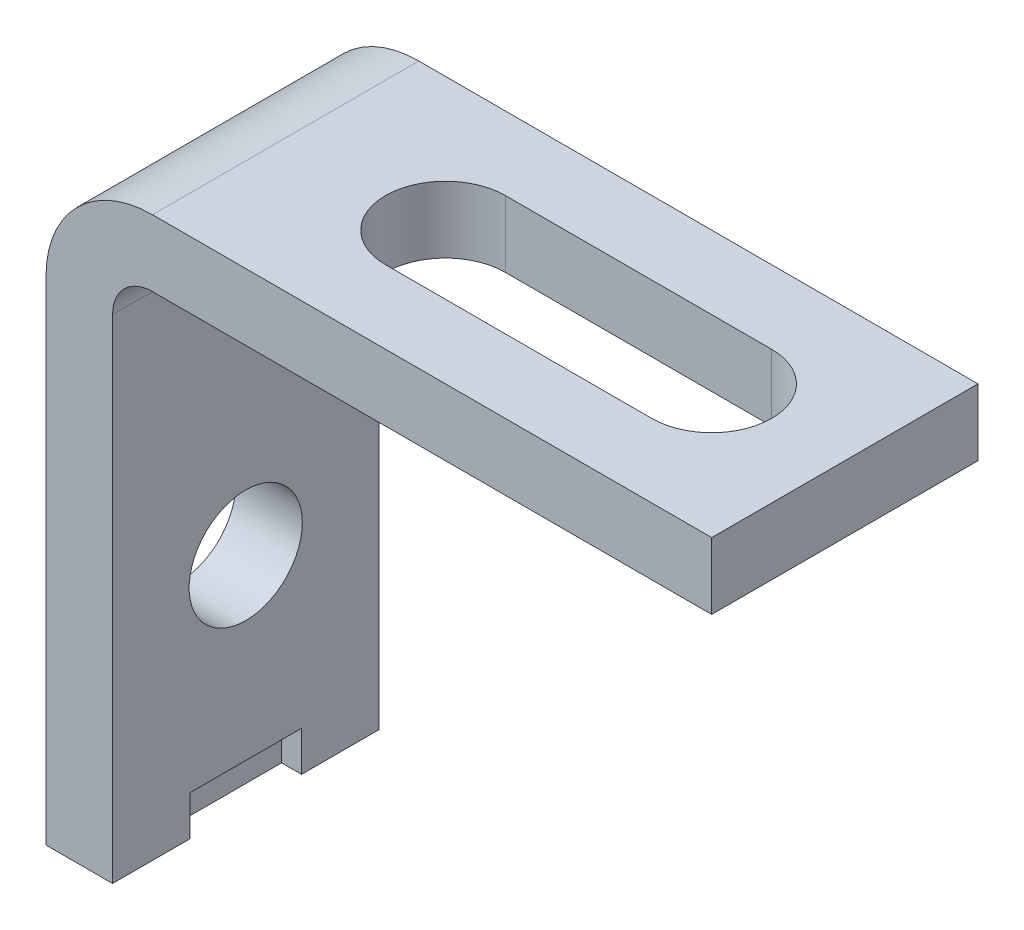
ISO-10303-21;
HEADER;
FILE_DESCRIPTION(('STEP AP214'),'2;1');
FILE_NAME('part.step','',(''),(''),'','','');
FILE_SCHEMA(('AUTOMOTIVE_DESIGN { 1 0 10303 214 1 1 1 1 }'));
ENDSEC;
DATA;
#1=APPLICATION_CONTEXT('core data for automotive mechanical design processes');
#2=APPLICATION_PROTOCOL_DEFINITION('international standard','automotive_design',2000,#1);
#3=PRODUCT_CONTEXT('',#1,'mechanical');
#4=PRODUCT('Part','Part','',(#3));
#5=PRODUCT_RELATED_PRODUCT_CATEGORY('part','',(#4));
#6=PRODUCT_DEFINITION_FORMATION('','',#4);
#7=PRODUCT_DEFINITION_CONTEXT('part definition',#1,'design');
#8=PRODUCT_DEFINITION('design','',#6,#7);
#9=PRODUCT_DEFINITION_SHAPE('','',#8);
#10=(LENGTH_UNIT() NAMED_UNIT(*) SI_UNIT(.MILLI.,.METRE.));
#11=(NAMED_UNIT(*) PLANE_ANGLE_UNIT() SI_UNIT($,.RADIAN.));
#12=(NAMED_UNIT(*) SI_UNIT($,.STERADIAN.) SOLID_ANGLE_UNIT());
#13=UNCERTAINTY_MEASURE_WITH_UNIT(LENGTH_MEASURE(1.E-05),#10,'distance_accuracy_value','');
#14=(GEOMETRIC_REPRESENTATION_CONTEXT(3) GLOBAL_UNCERTAINTY_ASSIGNED_CONTEXT((#13)) GLOBAL_UNIT_ASSIGNED_CONTEXT((#10,
#11,#12)) REPRESENTATION_CONTEXT('',''));
#15=CARTESIAN_POINT('',(0.,0.,0.));
#16=DIRECTION('',(0.,0.,1.));
#17=DIRECTION('',(1.,0.,0.));
#18=AXIS2_PLACEMENT_3D('',#15,#16,#17);
#19=CARTESIAN_POINT('',(20.,45.,-5.5));
#20=DIRECTION('',(0.,0.,1.));
#21=DIRECTION('',(1.,0.,0.));
#22=AXIS2_PLACEMENT_3D('',#19,#20,#21);
#23=PLANE('',#22);
#24=DIRECTION('',(0.,-1.,0.));
#25=VECTOR('',#24,1.);
#26=CARTESIAN_POINT('',(20.,45.,-5.5));
#27=LINE('',#26,#25);
#28=CARTESIAN_POINT('',(20.,40.,-5.5));
#29=VERTEX_POINT('',#28);
#30=CARTESIAN_POINT('',(20.,45.,-5.5));
#31=VERTEX_POINT('',#30);
#32=EDGE_CURVE('E199',#29,#31,#27,.F.);
#33=ORIENTED_EDGE('',*,*,#32,.T.);
#34=DIRECTION('',(1.,0.,0.));
#35=VECTOR('',#34,1.);
#36=CARTESIAN_POINT('',(50.,45.,-5.5));
#37=LINE('',#36,#35);
#38=CARTESIAN_POINT('',(40.,45.,-5.5));
#39=VERTEX_POINT('',#38);
#40=EDGE_CURVE('E238',#39,#31,#37,.F.);
#41=ORIENTED_EDGE('',*,*,#40,.F.);
#42=DIRECTION('',(0.,-1.,0.));
#43=VECTOR('',#42,1.);
#44=CARTESIAN_POINT('',(40.,45.,-5.5));
#45=LINE('',#44,#43);
#46=CARTESIAN_POINT('',(40.,40.,-5.5));
#47=VERTEX_POINT('',#46);
#48=EDGE_CURVE('E135',#39,#47,#45,.T.);
#49=ORIENTED_EDGE('',*,*,#48,.T.);
#50=DIRECTION('',(1.,0.,0.));
#51=VECTOR('',#50,1.);
#52=CARTESIAN_POINT('',(8.,40.,-5.5));
#53=LINE('',#52,#51);
#54=EDGE_CURVE('E162',#29,#47,#53,.T.);
#55=ORIENTED_EDGE('',*,*,#54,.F.);
#56=EDGE_LOOP('',(#33,#41,#49,#55));
#57=FACE_BOUND('',#56,.T.);
#58=ADVANCED_FACE('F15',(#57),#23,.F.);
#59=CARTESIAN_POINT('',(20.,45.,-10.));
#60=DIRECTION('',(0.,-1.,0.));
#61=DIRECTION('',(0.,0.,-1.));
#62=AXIS2_PLACEMENT_3D('',#59,#60,#61);
#63=CYLINDRICAL_SURFACE('',#62,4.5);
#64=DIRECTION('',(0.,1.,0.));
#65=VECTOR('',#64,1.);
#66=CARTESIAN_POINT('',(20.,45.,-14.5));
#67=LINE('',#66,#65);
#68=CARTESIAN_POINT('',(20.,40.,-14.5));
#69=VERTEX_POINT('',#68);
#70=CARTESIAN_POINT('',(20.,45.,-14.5));
#71=VERTEX_POINT('',#70);
#72=EDGE_CURVE('E150',#69,#71,#67,.T.);
#73=ORIENTED_EDGE('',*,*,#72,.T.);
#74=CARTESIAN_POINT('',(20.,45.,-10.));
#75=DIRECTION('',(0.,-1.,0.));
#76=DIRECTION('',(0.,0.,-1.));
#77=AXIS2_PLACEMENT_3D('',#74,#75,#76);
#78=CIRCLE('',#77,4.5);
#79=EDGE_CURVE('E236',#31,#71,#78,.T.);
#80=ORIENTED_EDGE('',*,*,#79,.F.);
#81=ORIENTED_EDGE('',*,*,#32,.F.);
#82=CARTESIAN_POINT('',(20.,40.,-10.));
#83=DIRECTION('',(0.,-1.,0.));
#84=DIRECTION('',(0.,0.,-1.));
#85=AXIS2_PLACEMENT_3D('',#82,#83,#84);
#86=CIRCLE('',#85,4.5);
#87=EDGE_CURVE('E158',#69,#29,#86,.F.);
#88=ORIENTED_EDGE('',*,*,#87,.F.);
#89=EDGE_LOOP('',(#73,#80,#81,#88));
#90=FACE_BOUND('',#89,.T.);
#91=ADVANCED_FACE('F506',(#90),#63,.F.);
#92=CARTESIAN_POINT('',(40.,45.,-14.5));
#93=DIRECTION('',(0.,0.,-1.));
#94=DIRECTION('',(-1.,0.,0.));
#95=AXIS2_PLACEMENT_3D('',#92,#93,#94);
#96=PLANE('',#95);
#97=DIRECTION('',(0.,-1.,0.));
#98=VECTOR('',#97,1.);
#99=CARTESIAN_POINT('',(40.,45.,-14.5));
#100=LINE('',#99,#98);
#101=CARTESIAN_POINT('',(40.,40.,-14.5));
#102=VERTEX_POINT('',#101);
#103=CARTESIAN_POINT('',(40.,45.,-14.5));
#104=VERTEX_POINT('',#103);
#105=EDGE_CURVE('E140',#102,#104,#100,.F.);
#106=ORIENTED_EDGE('',*,*,#105,.T.);
#107=DIRECTION('',(1.,0.,0.));
#108=VECTOR('',#107,1.);
#109=CARTESIAN_POINT('',(50.,45.,-14.5));
#110=LINE('',#109,#108);
#111=EDGE_CURVE('E235',#71,#104,#110,.T.);
#112=ORIENTED_EDGE('',*,*,#111,.F.);
#113=ORIENTED_EDGE('',*,*,#72,.F.);
#114=DIRECTION('',(1.,0.,0.));
#115=VECTOR('',#114,1.);
#116=CARTESIAN_POINT('',(8.,40.,-14.5));
#117=LINE('',#116,#115);
#118=EDGE_CURVE('E153',#102,#69,#117,.F.);
#119=ORIENTED_EDGE('',*,*,#118,.F.);
#120=EDGE_LOOP('',(#106,#112,#113,#119));
#121=FACE_BOUND('',#120,.T.);
#122=ADVANCED_FACE('F154',(#121),#96,.F.);
#123=CARTESIAN_POINT('',(40.,45.,-10.));
#124=DIRECTION('',(0.,-1.,0.));
#125=DIRECTION('',(0.,0.,-1.));
#126=AXIS2_PLACEMENT_3D('',#123,#124,#125);
#127=CYLINDRICAL_SURFACE('',#126,4.5);
#128=ORIENTED_EDGE('',*,*,#48,.F.);
#129=CARTESIAN_POINT('',(40.,45.,-10.));
#130=DIRECTION('',(0.,-1.,0.));
#131=DIRECTION('',(0.,0.,-1.));
#132=AXIS2_PLACEMENT_3D('',#129,#130,#131);
#133=CIRCLE('',#132,4.5);
#134=EDGE_CURVE('E146',#104,#39,#133,.T.);
#135=ORIENTED_EDGE('',*,*,#134,.F.);
#136=ORIENTED_EDGE('',*,*,#105,.F.);
#137=CARTESIAN_POINT('',(40.,40.,-10.));
#138=DIRECTION('',(0.,-1.,0.));
#139=DIRECTION('',(0.,0.,-1.));
#140=AXIS2_PLACEMENT_3D('',#137,#138,#139);
#141=CIRCLE('',#140,4.5);
#142=EDGE_CURVE('E19',#47,#102,#141,.F.);
#143=ORIENTED_EDGE('',*,*,#142,.F.);
#144=EDGE_LOOP('',(#128,#135,#136,#143));
#145=FACE_BOUND('',#144,.T.);
#146=ADVANCED_FACE('F142',(#145),#127,.F.);
#147=CARTESIAN_POINT('',(5.,0.,-14.191));
#148=DIRECTION('',(0.,0.,-1.));
#149=DIRECTION('',(-1.,0.,0.));
#150=AXIS2_PLACEMENT_3D('',#147,#148,#149);
#151=PLANE('',#150);
#152=DIRECTION('',(-1.,0.,0.));
#153=VECTOR('',#152,1.);
#154=CARTESIAN_POINT('',(5.,0.,-14.191));
#155=LINE('',#154,#153);
#156=CARTESIAN_POINT('',(5.,0.,-14.191));
#157=VERTEX_POINT('',#156);
#158=CARTESIAN_POINT('',(3.5,0.,-14.191));
#159=VERTEX_POINT('',#158);
#160=EDGE_CURVE('E189',#157,#159,#155,.T.);
#161=ORIENTED_EDGE('',*,*,#160,.F.);
#162=DIRECTION('',(0.,1.,0.));
#163=VECTOR('',#162,1.);
#164=CARTESIAN_POINT('',(5.,0.,-14.191));
#165=LINE('',#164,#163);
#166=CARTESIAN_POINT('',(5.,3.,-14.191));
#167=VERTEX_POINT('',#166);
#168=EDGE_CURVE('E173',#167,#157,#165,.F.);
#169=ORIENTED_EDGE('',*,*,#168,.F.);
#170=DIRECTION('',(1.,0.,0.));
#171=VECTOR('',#170,1.);
#172=CARTESIAN_POINT('',(5.,3.,-14.191));
#173=LINE('',#172,#171);
#174=CARTESIAN_POINT('',(3.5,3.,-14.191));
#175=VERTEX_POINT('',#174);
#176=EDGE_CURVE('E166',#167,#175,#173,.F.);
#177=ORIENTED_EDGE('',*,*,#176,.T.);
#178=DIRECTION('',(0.,1.,0.));
#179=VECTOR('',#178,1.);
#180=CARTESIAN_POINT('',(3.5,1.5,-14.191));
#181=LINE('',#180,#179);
#182=EDGE_CURVE('E207',#159,#175,#181,.T.);
#183=ORIENTED_EDGE('',*,*,#182,.F.);
#184=EDGE_LOOP('',(#161,#169,#177,#183));
#185=FACE_BOUND('',#184,.T.);
#186=ADVANCED_FACE('F336',(#185),#151,.F.);
#187=CARTESIAN_POINT('',(5.,3.,-5.809));
#188=DIRECTION('',(0.,0.,1.));
#189=DIRECTION('',(1.,0.,0.));
#190=AXIS2_PLACEMENT_3D('',#187,#188,#189);
#191=PLANE('',#190);
#192=DIRECTION('',(1.,0.,0.));
#193=VECTOR('',#192,1.);
#194=CARTESIAN_POINT('',(5.,3.,-5.809));
#195=LINE('',#194,#193);
#196=CARTESIAN_POINT('',(3.5,3.,-5.809));
#197=VERTEX_POINT('',#196);
#198=CARTESIAN_POINT('',(5.,3.,-5.809));
#199=VERTEX_POINT('',#198);
#200=EDGE_CURVE('E186',#197,#199,#195,.T.);
#201=ORIENTED_EDGE('',*,*,#200,.T.);
#202=DIRECTION('',(0.,1.,0.));
#203=VECTOR('',#202,1.);
#204=CARTESIAN_POINT('',(5.,0.,-5.809));
#205=LINE('',#204,#203);
#206=CARTESIAN_POINT('',(5.,0.,-5.809));
#207=VERTEX_POINT('',#206);
#208=EDGE_CURVE('E172',#207,#199,#205,.T.);
#209=ORIENTED_EDGE('',*,*,#208,.F.);
#210=DIRECTION('',(1.,0.,0.));
#211=VECTOR('',#210,1.);
#212=CARTESIAN_POINT('',(5.,0.,-5.809));
#213=LINE('',#212,#211);
#214=CARTESIAN_POINT('',(3.5,0.,-5.809));
#215=VERTEX_POINT('',#214);
#216=EDGE_CURVE('E187',#215,#207,#213,.T.);
#217=ORIENTED_EDGE('',*,*,#216,.F.);
#218=DIRECTION('',(0.,1.,0.));
#219=VECTOR('',#218,1.);
#220=CARTESIAN_POINT('',(3.5,1.5,-5.809));
#221=LINE('',#220,#219);
#222=EDGE_CURVE('E201',#197,#215,#221,.F.);
#223=ORIENTED_EDGE('',*,*,#222,.F.);
#224=EDGE_LOOP('',(#201,#209,#217,#223));
#225=FACE_BOUND('',#224,.T.);
#226=ADVANCED_FACE('F343',(#225),#191,.F.);
#227=CARTESIAN_POINT('',(5.,3.,-14.191));
#228=DIRECTION('',(0.,1.,0.));
#229=DIRECTION('',(0.,0.,1.));
#230=AXIS2_PLACEMENT_3D('',#227,#228,#229);
#231=PLANE('',#230);
#232=ORIENTED_EDGE('',*,*,#176,.F.);
#233=DIRECTION('',(0.,0.,-1.));
#234=VECTOR('',#233,1.);
#235=CARTESIAN_POINT('',(5.,3.,0.));
#236=LINE('',#235,#234);
#237=EDGE_CURVE('E190',#199,#167,#236,.T.);
#238=ORIENTED_EDGE('',*,*,#237,.F.);
#239=ORIENTED_EDGE('',*,*,#200,.F.);
#240=DIRECTION('',(0.,0.,-1.));
#241=VECTOR('',#240,1.);
#242=CARTESIAN_POINT('',(3.5,3.,-10.));
#243=LINE('',#242,#241);
#244=EDGE_CURVE('E204',#175,#197,#243,.F.);
#245=ORIENTED_EDGE('',*,*,#244,.F.);
#246=EDGE_LOOP('',(#232,#238,#239,#245));
#247=FACE_BOUND('',#246,.T.);
#248=ADVANCED_FACE('F474',(#247),#231,.F.);
#249=CARTESIAN_POINT('',(8.,37.,0.));
#250=DIRECTION('',(0.,0.,-1.));
#251=DIRECTION('',(-1.,0.,0.));
#252=AXIS2_PLACEMENT_3D('',#249,#250,#251);
#253=CYLINDRICAL_SURFACE('',#252,3.);
#254=DIRECTION('',(0.,0.,-1.));
#255=VECTOR('',#254,1.);
#256=CARTESIAN_POINT('',(8.,40.,0.));
#257=LINE('',#256,#255);
#258=CARTESIAN_POINT('',(8.,40.,0.));
#259=VERTEX_POINT('',#258);
#260=CARTESIAN_POINT('',(8.,40.,-20.));
#261=VERTEX_POINT('',#260);
#262=EDGE_CURVE('E163',#259,#261,#257,.T.);
#263=ORIENTED_EDGE('',*,*,#262,.F.);
#264=CARTESIAN_POINT('',(8.,37.,0.));
#265=DIRECTION('',(0.,0.,-1.));
#266=DIRECTION('',(-1.,0.,0.));
#267=AXIS2_PLACEMENT_3D('',#264,#265,#266);
#268=CIRCLE('',#267,3.);
#269=CARTESIAN_POINT('',(5.,37.,0.));
#270=VERTEX_POINT('',#269);
#271=EDGE_CURVE('E230',#270,#259,#268,.T.);
#272=ORIENTED_EDGE('',*,*,#271,.F.);
#273=DIRECTION('',(0.,0.,-1.));
#274=VECTOR('',#273,1.);
#275=CARTESIAN_POINT('',(5.,37.,0.));
#276=LINE('',#275,#274);
#277=CARTESIAN_POINT('',(5.,37.,-20.));
#278=VERTEX_POINT('',#277);
#279=EDGE_CURVE('E170',#278,#270,#276,.F.);
#280=ORIENTED_EDGE('',*,*,#279,.F.);
#281=CARTESIAN_POINT('',(8.,37.,-20.));
#282=DIRECTION('',(0.,0.,-1.));
#283=DIRECTION('',(-1.,0.,0.));
#284=AXIS2_PLACEMENT_3D('',#281,#282,#283);
#285=CIRCLE('',#284,3.);
#286=EDGE_CURVE('E222',#278,#261,#285,.T.);
#287=ORIENTED_EDGE('',*,*,#286,.T.);
#288=EDGE_LOOP('',(#263,#272,#280,#287));
#289=FACE_BOUND('',#288,.T.);
#290=ADVANCED_FACE('F352',(#289),#253,.F.);
#291=CARTESIAN_POINT('',(8.,40.,0.));
#292=DIRECTION('',(0.,-1.,0.));
#293=DIRECTION('',(0.,0.,-1.));
#294=AXIS2_PLACEMENT_3D('',#291,#292,#293);
#295=PLANE('',#294);
#296=ORIENTED_EDGE('',*,*,#118,.T.);
#297=ORIENTED_EDGE('',*,*,#87,.T.);
#298=ORIENTED_EDGE('',*,*,#54,.T.);
#299=ORIENTED_EDGE('',*,*,#142,.T.);
#300=EDGE_LOOP('',(#296,#297,#298,#299));
#301=FACE_BOUND('',#300,.T.);
#302=DIRECTION('',(1.,0.,0.));
#303=VECTOR('',#302,1.);
#304=CARTESIAN_POINT('',(15.9235239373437,40.,0.));
#305=LINE('',#304,#303);
#306=CARTESIAN_POINT('',(50.,40.,0.));
#307=VERTEX_POINT('',#306);
#308=EDGE_CURVE('E178',#259,#307,#305,.T.);
#309=ORIENTED_EDGE('',*,*,#308,.F.);
#310=ORIENTED_EDGE('',*,*,#262,.T.);
#311=DIRECTION('',(1.,0.,0.));
#312=VECTOR('',#311,1.);
#313=CARTESIAN_POINT('',(15.9235239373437,40.,-20.));
#314=LINE('',#313,#312);
#315=CARTESIAN_POINT('',(50.,40.,-20.));
#316=VERTEX_POINT('',#315);
#317=EDGE_CURVE('E224',#261,#316,#314,.T.);
#318=ORIENTED_EDGE('',*,*,#317,.T.);
#319=DIRECTION('',(0.,0.,-1.));
#320=VECTOR('',#319,1.);
#321=CARTESIAN_POINT('',(50.,40.,0.));
#322=LINE('',#321,#320);
#323=EDGE_CURVE('E239',#307,#316,#322,.T.);
#324=ORIENTED_EDGE('',*,*,#323,.F.);
#325=EDGE_LOOP('',(#309,#310,#318,#324));
#326=FACE_BOUND('',#325,.T.);
#327=ADVANCED_FACE('F160',(#301,#326),#295,.T.);
#328=CARTESIAN_POINT('',(50.,40.,0.));
#329=DIRECTION('',(1.,0.,0.));
#330=DIRECTION('',(0.,0.,-1.));
#331=AXIS2_PLACEMENT_3D('',#328,#329,#330);
#332=PLANE('',#331);
#333=DIRECTION('',(0.,1.,0.));
#334=VECTOR('',#333,1.);
#335=CARTESIAN_POINT('',(50.,31.6401806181,0.));
#336=LINE('',#335,#334);
#337=CARTESIAN_POINT('',(50.,45.,0.));
#338=VERTEX_POINT('',#337);
#339=EDGE_CURVE('E174',#307,#338,#336,.T.);
#340=ORIENTED_EDGE('',*,*,#339,.F.);
#341=ORIENTED_EDGE('',*,*,#323,.T.);
#342=DIRECTION('',(0.,1.,0.));
#343=VECTOR('',#342,1.);
#344=CARTESIAN_POINT('',(50.,31.6401806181,-20.));
#345=LINE('',#344,#343);
#346=CARTESIAN_POINT('',(50.,45.,-20.));
#347=VERTEX_POINT('',#346);
#348=EDGE_CURVE('E248',#316,#347,#345,.T.);
#349=ORIENTED_EDGE('',*,*,#348,.T.);
#350=DIRECTION('',(0.,0.,1.));
#351=VECTOR('',#350,1.);
#352=CARTESIAN_POINT('',(50.,45.,0.));
#353=LINE('',#352,#351);
#354=EDGE_CURVE('E241',#338,#347,#353,.F.);
#355=ORIENTED_EDGE('',*,*,#354,.F.);
#356=EDGE_LOOP('',(#340,#341,#349,#355));
#357=FACE_BOUND('',#356,.T.);
#358=ADVANCED_FACE('F355',(#357),#332,.T.);
#359=CARTESIAN_POINT('',(50.,45.,0.));
#360=DIRECTION('',(0.,1.,0.));
#361=DIRECTION('',(0.,0.,1.));
#362=AXIS2_PLACEMENT_3D('',#359,#360,#361);
#363=PLANE('',#362);
#364=ORIENTED_EDGE('',*,*,#111,.T.);
#365=ORIENTED_EDGE('',*,*,#134,.T.);
#366=ORIENTED_EDGE('',*,*,#40,.T.);
#367=ORIENTED_EDGE('',*,*,#79,.T.);
#368=EDGE_LOOP('',(#364,#365,#366,#367));
#369=FACE_BOUND('',#368,.T.);
#370=DIRECTION('',(1.,0.,0.));
#371=VECTOR('',#370,1.);
#372=CARTESIAN_POINT('',(15.9235239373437,45.,0.));
#373=LINE('',#372,#371);
#374=CARTESIAN_POINT('',(8.,45.,0.));
#375=VERTEX_POINT('',#374);
#376=EDGE_CURVE('E177',#338,#375,#373,.F.);
#377=ORIENTED_EDGE('',*,*,#376,.F.);
#378=ORIENTED_EDGE('',*,*,#354,.T.);
#379=DIRECTION('',(1.,0.,0.));
#380=VECTOR('',#379,1.);
#381=CARTESIAN_POINT('',(15.9235239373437,45.,-20.));
#382=LINE('',#381,#380);
#383=CARTESIAN_POINT('',(8.,45.,-20.));
#384=VERTEX_POINT('',#383);
#385=EDGE_CURVE('E221',#347,#384,#382,.F.);
#386=ORIENTED_EDGE('',*,*,#385,.T.);
#387=DIRECTION('',(0.,0.,-1.));
#388=VECTOR('',#387,1.);
#389=CARTESIAN_POINT('',(8.,45.,0.));
#390=LINE('',#389,#388);
#391=EDGE_CURVE('E229',#375,#384,#390,.T.);
#392=ORIENTED_EDGE('',*,*,#391,.F.);
#393=EDGE_LOOP('',(#377,#378,#386,#392));
#394=FACE_BOUND('',#393,.T.);
#395=ADVANCED_FACE('F312',(#369,#394),#363,.T.);
#396=CARTESIAN_POINT('',(-0.75,0.75,-5.));
#397=DIRECTION('',(-0.707106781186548,-0.707106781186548,0.));
#398=DIRECTION('',(0.707106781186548,-0.707106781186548,0.));
#399=AXIS2_PLACEMENT_3D('',#396,#397,#398);
#400=PLANE('',#399);
#401=DIRECTION('',(0.707106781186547,-0.707106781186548,0.));
#402=VECTOR('',#401,1.);
#403=CARTESIAN_POINT('',(-1.5,1.5,-5.809));
#404=LINE('',#403,#402);
#405=CARTESIAN_POINT('',(-1.5,1.5,-5.809));
#406=VERTEX_POINT('',#405);
#407=CARTESIAN_POINT('',(0.,0.,-5.809));
#408=VERTEX_POINT('',#407);
#409=EDGE_CURVE('E182',#406,#408,#404,.T.);
#410=ORIENTED_EDGE('',*,*,#409,.F.);
#411=DIRECTION('',(0.,0.,1.));
#412=VECTOR('',#411,1.);
#413=CARTESIAN_POINT('',(-1.5,1.5,-12.0955));
#414=LINE('',#413,#412);
#415=CARTESIAN_POINT('',(-1.5,1.5,-14.191));
#416=VERTEX_POINT('',#415);
#417=EDGE_CURVE('E179',#416,#406,#414,.T.);
#418=ORIENTED_EDGE('',*,*,#417,.F.);
#419=DIRECTION('',(-0.707106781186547,0.707106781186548,0.));
#420=VECTOR('',#419,1.);
#421=CARTESIAN_POINT('',(0.,0.,-14.191));
#422=LINE('',#421,#420);
#423=CARTESIAN_POINT('',(0.,0.,-14.191));
#424=VERTEX_POINT('',#423);
#425=EDGE_CURVE('E193',#424,#416,#422,.T.);
#426=ORIENTED_EDGE('',*,*,#425,.F.);
#427=DIRECTION('',(0.,0.,-1.));
#428=VECTOR('',#427,1.);
#429=CARTESIAN_POINT('',(0.,0.,0.));
#430=LINE('',#429,#428);
#431=EDGE_CURVE('E220',#408,#424,#430,.T.);
#432=ORIENTED_EDGE('',*,*,#431,.F.);
#433=EDGE_LOOP('',(#410,#418,#426,#432));
#434=FACE_BOUND('',#433,.T.);
#435=ADVANCED_FACE('F367',(#434),#400,.T.);
#436=CARTESIAN_POINT('',(3.5,1.5,-10.));
#437=DIRECTION('',(1.,0.,0.));
#438=DIRECTION('',(0.,0.,-1.));
#439=AXIS2_PLACEMENT_3D('',#436,#437,#438);
#440=PLANE('',#439);
#441=ORIENTED_EDGE('',*,*,#222,.T.);
#442=DIRECTION('',(0.,0.,-1.));
#443=VECTOR('',#442,1.);
#444=CARTESIAN_POINT('',(3.5,0.,0.));
#445=LINE('',#444,#443);
#446=EDGE_CURVE('E208',#159,#215,#445,.F.);
#447=ORIENTED_EDGE('',*,*,#446,.F.);
#448=ORIENTED_EDGE('',*,*,#182,.T.);
#449=ORIENTED_EDGE('',*,*,#244,.T.);
#450=EDGE_LOOP('',(#441,#447,#448,#449));
#451=FACE_BOUND('',#450,.T.);
#452=ADVANCED_FACE('F340',(#451),#440,.T.);
#453=CARTESIAN_POINT('',(5.,0.,0.));
#454=DIRECTION('',(1.,0.,0.));
#455=DIRECTION('',(0.,0.,-1.));
#456=AXIS2_PLACEMENT_3D('',#453,#454,#455);
#457=PLANE('',#456);
#458=CARTESIAN_POINT('',(5.,16.35,-10.));
#459=DIRECTION('',(1.,0.,0.));
#460=DIRECTION('',(0.,0.,-1.));
#461=AXIS2_PLACEMENT_3D('',#458,#459,#460);
#462=CIRCLE('',#461,4.25);
#463=CARTESIAN_POINT('',(5.,16.35,-14.25));
#464=VERTEX_POINT('',#463);
#465=EDGE_CURVE('E213',#464,#464,#462,.F.);
#466=ORIENTED_EDGE('',*,*,#465,.T.);
#467=EDGE_LOOP('',(#466));
#468=FACE_BOUND('',#467,.T.);
#469=ORIENTED_EDGE('',*,*,#208,.T.);
#470=ORIENTED_EDGE('',*,*,#237,.T.);
#471=ORIENTED_EDGE('',*,*,#168,.T.);
#472=DIRECTION('',(0.,0.,-1.));
#473=VECTOR('',#472,1.);
#474=CARTESIAN_POINT('',(5.,0.,0.));
#475=LINE('',#474,#473);
#476=CARTESIAN_POINT('',(5.,0.,-20.));
#477=VERTEX_POINT('',#476);
#478=EDGE_CURVE('E211',#477,#157,#475,.F.);
#479=ORIENTED_EDGE('',*,*,#478,.F.);
#480=DIRECTION('',(0.,1.,0.));
#481=VECTOR('',#480,1.);
#482=CARTESIAN_POINT('',(5.,31.6401806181,-20.));
#483=LINE('',#482,#481);
#484=EDGE_CURVE('E225',#477,#278,#483,.T.);
#485=ORIENTED_EDGE('',*,*,#484,.T.);
#486=ORIENTED_EDGE('',*,*,#279,.T.);
#487=DIRECTION('',(0.,1.,0.));
#488=VECTOR('',#487,1.);
#489=CARTESIAN_POINT('',(5.,31.6401806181,0.));
#490=LINE('',#489,#488);
#491=CARTESIAN_POINT('',(5.,0.,0.));
#492=VERTEX_POINT('',#491);
#493=EDGE_CURVE('E233',#492,#270,#490,.T.);
#494=ORIENTED_EDGE('',*,*,#493,.F.);
#495=DIRECTION('',(0.,0.,-1.));
#496=VECTOR('',#495,1.);
#497=CARTESIAN_POINT('',(5.,0.,0.));
#498=LINE('',#497,#496);
#499=EDGE_CURVE('E210',#207,#492,#498,.F.);
#500=ORIENTED_EDGE('',*,*,#499,.F.);
#501=EDGE_LOOP('',(#469,#470,#471,#479,#485,#486,#494,#500));
#502=FACE_BOUND('',#501,.T.);
#503=ADVANCED_FACE('F348',(#468,#502),#457,.T.);
#504=CARTESIAN_POINT('',(0.,0.,-14.191));
#505=DIRECTION('',(0.,0.,-1.));
#506=DIRECTION('',(-1.,0.,0.));
#507=AXIS2_PLACEMENT_3D('',#504,#505,#506);
#508=PLANE('',#507);
#509=DIRECTION('',(-0.707106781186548,-0.707106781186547,0.));
#510=VECTOR('',#509,1.);
#511=CARTESIAN_POINT('',(-0.75,2.25,-14.191));
#512=LINE('',#511,#510);
#513=CARTESIAN_POINT('',(0.,3.,-14.191));
#514=VERTEX_POINT('',#513);
#515=EDGE_CURVE('E183',#514,#416,#512,.T.);
#516=ORIENTED_EDGE('',*,*,#515,.F.);
#517=DIRECTION('',(0.,1.,0.));
#518=VECTOR('',#517,1.);
#519=CARTESIAN_POINT('',(0.,37.,-14.191));
#520=LINE('',#519,#518);
#521=EDGE_CURVE('E216',#424,#514,#520,.T.);
#522=ORIENTED_EDGE('',*,*,#521,.F.);
#523=ORIENTED_EDGE('',*,*,#425,.T.);
#524=EDGE_LOOP('',(#516,#522,#523));
#525=FACE_BOUND('',#524,.T.);
#526=ADVANCED_FACE('F359',(#525),#508,.T.);
#527=CARTESIAN_POINT('',(-0.75,2.25,-12.0955));
#528=DIRECTION('',(-0.707106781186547,0.707106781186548,0.));
#529=DIRECTION('',(-0.707106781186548,-0.707106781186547,0.));
#530=AXIS2_PLACEMENT_3D('',#527,#528,#529);
#531=PLANE('',#530);
#532=ORIENTED_EDGE('',*,*,#515,.T.);
#533=ORIENTED_EDGE('',*,*,#417,.T.);
#534=DIRECTION('',(-0.707106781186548,-0.707106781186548,0.));
#535=VECTOR('',#534,1.);
#536=CARTESIAN_POINT('',(0.,3.,-5.809));
#537=LINE('',#536,#535);
#538=CARTESIAN_POINT('',(0.,3.,-5.809));
#539=VERTEX_POINT('',#538);
#540=EDGE_CURVE('E274',#539,#406,#537,.T.);
#541=ORIENTED_EDGE('',*,*,#540,.F.);
#542=DIRECTION('',(0.,0.,1.));
#543=VECTOR('',#542,1.);
#544=CARTESIAN_POINT('',(0.,3.,0.));
#545=LINE('',#544,#543);
#546=EDGE_CURVE('E268',#514,#539,#545,.T.);
#547=ORIENTED_EDGE('',*,*,#546,.F.);
#548=EDGE_LOOP('',(#532,#533,#541,#547));
#549=FACE_BOUND('',#548,.T.);
#550=ADVANCED_FACE('F362',(#549),#531,.T.);
#551=CARTESIAN_POINT('',(0.,3.,-5.809));
#552=DIRECTION('',(0.,0.,1.));
#553=DIRECTION('',(1.,0.,0.));
#554=AXIS2_PLACEMENT_3D('',#551,#552,#553);
#555=PLANE('',#554);
#556=DIRECTION('',(0.,1.,0.));
#557=VECTOR('',#556,1.);
#558=CARTESIAN_POINT('',(0.,37.,-5.809));
#559=LINE('',#558,#557);
#560=EDGE_CURVE('E273',#539,#408,#559,.F.);
#561=ORIENTED_EDGE('',*,*,#560,.F.);
#562=ORIENTED_EDGE('',*,*,#540,.T.);
#563=ORIENTED_EDGE('',*,*,#409,.T.);
#564=EDGE_LOOP('',(#561,#562,#563));
#565=FACE_BOUND('',#564,.T.);
#566=ADVANCED_FACE('F365',(#565),#555,.T.);
#567=CARTESIAN_POINT('',(15.9235239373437,31.6401806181,0.));
#568=DIRECTION('',(0.,0.,1.));
#569=DIRECTION('',(1.,0.,0.));
#570=AXIS2_PLACEMENT_3D('',#567,#568,#569);
#571=PLANE('',#570);
#572=ORIENTED_EDGE('',*,*,#376,.T.);
#573=CARTESIAN_POINT('',(8.,37.,0.));
#574=DIRECTION('',(0.,0.,-1.));
#575=DIRECTION('',(-1.,0.,0.));
#576=AXIS2_PLACEMENT_3D('',#573,#574,#575);
#577=CIRCLE('',#576,8.);
#578=CARTESIAN_POINT('',(0.,37.,0.));
#579=VERTEX_POINT('',#578);
#580=EDGE_CURVE('E226',#579,#375,#577,.T.);
#581=ORIENTED_EDGE('',*,*,#580,.F.);
#582=DIRECTION('',(0.,1.,0.));
#583=VECTOR('',#582,1.);
#584=CARTESIAN_POINT('',(0.,37.,0.));
#585=LINE('',#584,#583);
#586=CARTESIAN_POINT('',(0.,0.,0.));
#587=VERTEX_POINT('',#586);
#588=EDGE_CURVE('E288',#587,#579,#585,.T.);
#589=ORIENTED_EDGE('',*,*,#588,.F.);
#590=DIRECTION('',(1.,0.,0.));
#591=VECTOR('',#590,1.);
#592=CARTESIAN_POINT('',(0.,0.,0.));
#593=LINE('',#592,#591);
#594=EDGE_CURVE('E217',#492,#587,#593,.F.);
#595=ORIENTED_EDGE('',*,*,#594,.F.);
#596=ORIENTED_EDGE('',*,*,#493,.T.);
#597=ORIENTED_EDGE('',*,*,#271,.T.);
#598=ORIENTED_EDGE('',*,*,#308,.T.);
#599=ORIENTED_EDGE('',*,*,#339,.T.);
#600=EDGE_LOOP('',(#572,#581,#589,#595,#596,#597,#598,#599));
#601=FACE_BOUND('',#600,.T.);
#602=ADVANCED_FACE('F324',(#601),#571,.T.);
#603=CARTESIAN_POINT('',(8.,37.,0.));
#604=DIRECTION('',(0.,0.,-1.));
#605=DIRECTION('',(-1.,0.,0.));
#606=AXIS2_PLACEMENT_3D('',#603,#604,#605);
#607=CYLINDRICAL_SURFACE('',#606,8.);
#608=ORIENTED_EDGE('',*,*,#580,.T.);
#609=ORIENTED_EDGE('',*,*,#391,.T.);
#610=CARTESIAN_POINT('',(8.,37.,-20.));
#611=DIRECTION('',(0.,0.,-1.));
#612=DIRECTION('',(-1.,0.,0.));
#613=AXIS2_PLACEMENT_3D('',#610,#611,#612);
#614=CIRCLE('',#613,8.);
#615=CARTESIAN_POINT('',(0.,37.,-20.));
#616=VERTEX_POINT('',#615);
#617=EDGE_CURVE('E218',#384,#616,#614,.F.);
#618=ORIENTED_EDGE('',*,*,#617,.T.);
#619=DIRECTION('',(0.,0.,1.));
#620=VECTOR('',#619,1.);
#621=CARTESIAN_POINT('',(0.,37.,0.));
#622=LINE('',#621,#620);
#623=EDGE_CURVE('E296',#579,#616,#622,.F.);
#624=ORIENTED_EDGE('',*,*,#623,.F.);
#625=EDGE_LOOP('',(#608,#609,#618,#624));
#626=FACE_BOUND('',#625,.T.);
#627=ADVANCED_FACE('F315',(#626),#607,.T.);
#628=CARTESIAN_POINT('',(15.9235239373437,31.6401806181,-20.));
#629=DIRECTION('',(0.,0.,1.));
#630=DIRECTION('',(1.,0.,0.));
#631=AXIS2_PLACEMENT_3D('',#628,#629,#630);
#632=PLANE('',#631);
#633=DIRECTION('',(0.,1.,0.));
#634=VECTOR('',#633,1.);
#635=CARTESIAN_POINT('',(0.,37.,-20.));
#636=LINE('',#635,#634);
#637=CARTESIAN_POINT('',(0.,0.,-20.));
#638=VERTEX_POINT('',#637);
#639=EDGE_CURVE('E300',#616,#638,#636,.F.);
#640=ORIENTED_EDGE('',*,*,#639,.F.);
#641=ORIENTED_EDGE('',*,*,#617,.F.);
#642=ORIENTED_EDGE('',*,*,#385,.F.);
#643=ORIENTED_EDGE('',*,*,#348,.F.);
#644=ORIENTED_EDGE('',*,*,#317,.F.);
#645=ORIENTED_EDGE('',*,*,#286,.F.);
#646=ORIENTED_EDGE('',*,*,#484,.F.);
#647=DIRECTION('',(1.,0.,0.));
#648=VECTOR('',#647,1.);
#649=CARTESIAN_POINT('',(0.,0.,-20.));
#650=LINE('',#649,#648);
#651=EDGE_CURVE('E34',#638,#477,#650,.T.);
#652=ORIENTED_EDGE('',*,*,#651,.F.);
#653=EDGE_LOOP('',(#640,#641,#642,#643,#644,#645,#646,#652));
#654=FACE_BOUND('',#653,.T.);
#655=ADVANCED_FACE('F317',(#654),#632,.F.);
#656=CARTESIAN_POINT('',(0.,0.,0.));
#657=DIRECTION('',(0.,-1.,0.));
#658=DIRECTION('',(0.,0.,-1.));
#659=AXIS2_PLACEMENT_3D('',#656,#657,#658);
#660=PLANE('',#659);
#661=ORIENTED_EDGE('',*,*,#594,.T.);
#662=DIRECTION('',(0.,0.,1.));
#663=VECTOR('',#662,1.);
#664=CARTESIAN_POINT('',(0.,0.,0.));
#665=LINE('',#664,#663);
#666=EDGE_CURVE('E281',#408,#587,#665,.T.);
#667=ORIENTED_EDGE('',*,*,#666,.F.);
#668=ORIENTED_EDGE('',*,*,#431,.T.);
#669=DIRECTION('',(0.,0.,1.));
#670=VECTOR('',#669,1.);
#671=CARTESIAN_POINT('',(0.,0.,0.));
#672=LINE('',#671,#670);
#673=EDGE_CURVE('E25',#638,#424,#672,.T.);
#674=ORIENTED_EDGE('',*,*,#673,.F.);
#675=ORIENTED_EDGE('',*,*,#651,.T.);
#676=ORIENTED_EDGE('',*,*,#478,.T.);
#677=ORIENTED_EDGE('',*,*,#160,.T.);
#678=ORIENTED_EDGE('',*,*,#446,.T.);
#679=ORIENTED_EDGE('',*,*,#216,.T.);
#680=ORIENTED_EDGE('',*,*,#499,.T.);
#681=EDGE_LOOP('',(#661,#667,#668,#674,#675,#676,#677,#678,#679,#680));
#682=FACE_BOUND('',#681,.T.);
#683=ADVANCED_FACE('F332',(#682),#660,.T.);
#684=CARTESIAN_POINT('',(0.,16.35,-10.));
#685=DIRECTION('',(1.,0.,0.));
#686=DIRECTION('',(0.,0.,-1.));
#687=AXIS2_PLACEMENT_3D('',#684,#685,#686);
#688=CYLINDRICAL_SURFACE('',#687,4.25);
#689=CARTESIAN_POINT('',(0.,16.35,-10.));
#690=DIRECTION('',(1.,0.,0.));
#691=DIRECTION('',(0.,0.,-1.));
#692=AXIS2_PLACEMENT_3D('',#689,#690,#691);
#693=CIRCLE('',#692,4.25);
#694=CARTESIAN_POINT('',(0.,16.35,-14.25));
#695=VERTEX_POINT('',#694);
#696=EDGE_CURVE('E10',#695,#695,#693,.T.);
#697=ORIENTED_EDGE('',*,*,#696,.F.);
#698=EDGE_LOOP('',(#697));
#699=FACE_BOUND('',#698,.T.);
#700=ORIENTED_EDGE('',*,*,#465,.F.);
#701=EDGE_LOOP('',(#700));
#702=FACE_BOUND('',#701,.T.);
#703=ADVANCED_FACE('F17',(#699,#702),#688,.F.);
#704=CARTESIAN_POINT('',(0.,37.,0.));
#705=DIRECTION('',(-1.,0.,0.));
#706=DIRECTION('',(0.,0.,1.));
#707=AXIS2_PLACEMENT_3D('',#704,#705,#706);
#708=PLANE('',#707);
#709=ORIENTED_EDGE('',*,*,#696,.T.);
#710=EDGE_LOOP('',(#709));
#711=FACE_BOUND('',#710,.T.);
#712=ORIENTED_EDGE('',*,*,#639,.T.);
#713=ORIENTED_EDGE('',*,*,#673,.T.);
#714=ORIENTED_EDGE('',*,*,#521,.T.);
#715=ORIENTED_EDGE('',*,*,#546,.T.);
#716=ORIENTED_EDGE('',*,*,#560,.T.);
#717=ORIENTED_EDGE('',*,*,#666,.T.);
#718=ORIENTED_EDGE('',*,*,#588,.T.);
#719=ORIENTED_EDGE('',*,*,#623,.T.);
#720=EDGE_LOOP('',(#712,#713,#714,#715,#716,#717,#718,#719));
#721=FACE_BOUND('',#720,.T.);
#722=ADVANCED_FACE('F319',(#711,#721),#708,.T.);
#723=CLOSED_SHELL('',(#58,#91,#122,#146,#186,#226,#248,#290,#327,#358,#395,#435,#452,#503,#526,
#550,#566,#602,#627,#655,#683,#703,#722));
#724=MANIFOLD_SOLID_BREP('B1',#723);
#725=ADVANCED_BREP_SHAPE_REPRESENTATION('',(#18,#724),#14);
#726=SHAPE_DEFINITION_REPRESENTATION(#9,#725);
ENDSEC;
END-ISO-10303-21;
